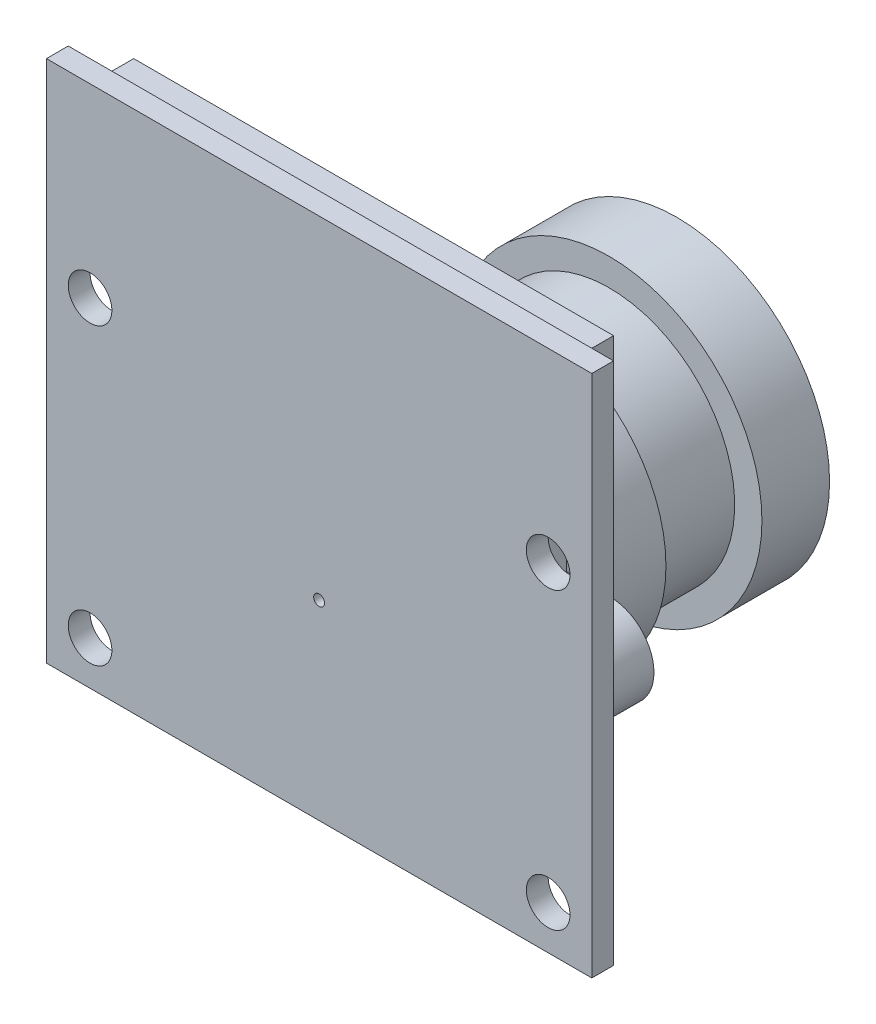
ISO-10303-21;
HEADER;
FILE_DESCRIPTION(('STEP AP214'),'2;1');
FILE_NAME('part.step','',(''),(''),'','','');
FILE_SCHEMA(('AUTOMOTIVE_DESIGN { 1 0 10303 214 1 1 1 1 }'));
ENDSEC;
DATA;
#1=APPLICATION_CONTEXT('core data for automotive mechanical design processes');
#2=APPLICATION_PROTOCOL_DEFINITION('international standard','automotive_design',2000,#1);
#3=PRODUCT_CONTEXT('',#1,'mechanical');
#4=PRODUCT('Part','Part','',(#3));
#5=PRODUCT_RELATED_PRODUCT_CATEGORY('part','',(#4));
#6=PRODUCT_DEFINITION_FORMATION('','',#4);
#7=PRODUCT_DEFINITION_CONTEXT('part definition',#1,'design');
#8=PRODUCT_DEFINITION('design','',#6,#7);
#9=PRODUCT_DEFINITION_SHAPE('','',#8);
#10=(LENGTH_UNIT() NAMED_UNIT(*) SI_UNIT(.MILLI.,.METRE.));
#11=(NAMED_UNIT(*) PLANE_ANGLE_UNIT() SI_UNIT($,.RADIAN.));
#12=(NAMED_UNIT(*) SI_UNIT($,.STERADIAN.) SOLID_ANGLE_UNIT());
#13=UNCERTAINTY_MEASURE_WITH_UNIT(LENGTH_MEASURE(1.E-05),#10,'distance_accuracy_value','');
#14=(GEOMETRIC_REPRESENTATION_CONTEXT(3) GLOBAL_UNCERTAINTY_ASSIGNED_CONTEXT((#13)) GLOBAL_UNIT_ASSIGNED_CONTEXT((#10,
#11,#12)) REPRESENTATION_CONTEXT('',''));
#15=CARTESIAN_POINT('',(0.,0.,0.));
#16=DIRECTION('',(0.,0.,1.));
#17=DIRECTION('',(1.,0.,0.));
#18=AXIS2_PLACEMENT_3D('',#15,#16,#17);
#19=CARTESIAN_POINT('',(3.94999511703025,8.74999999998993,-4.8));
#20=DIRECTION('',(0.,0.,1.));
#21=DIRECTION('',(1.,0.,0.));
#22=AXIS2_PLACEMENT_3D('',#19,#20,#21);
#23=PLANE('',#22);
#24=CARTESIAN_POINT('',(12.5,8.75,-4.8));
#25=DIRECTION('',(0.,0.,-1.));
#26=DIRECTION('',(-1.,0.,0.));
#27=AXIS2_PLACEMENT_3D('',#24,#25,#26);
#28=CIRCLE('',#27,6.6);
#29=CARTESIAN_POINT('',(13.3108637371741,15.2999999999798,-4.8));
#30=VERTEX_POINT('',#29);
#31=CARTESIAN_POINT('',(13.3108637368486,2.19999999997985,-4.8));
#32=VERTEX_POINT('',#31);
#33=EDGE_CURVE('E11',#30,#32,#28,.T.);
#34=ORIENTED_EDGE('',*,*,#33,.F.);
#35=DIRECTION('',(1.,0.,0.));
#36=VECTOR('',#35,1.);
#37=CARTESIAN_POINT('',(19.05,15.2999999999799,-4.8));
#38=LINE('',#37,#36);
#39=CARTESIAN_POINT('',(19.05,15.2999999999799,-4.8));
#40=VERTEX_POINT('',#39);
#41=EDGE_CURVE('E196',#30,#40,#38,.T.);
#42=ORIENTED_EDGE('',*,*,#41,.T.);
#43=DIRECTION('',(0.,-1.,0.));
#44=VECTOR('',#43,1.);
#45=CARTESIAN_POINT('',(19.05,10.75,-4.8));
#46=LINE('',#45,#44);
#47=CARTESIAN_POINT('',(19.05,10.75,-4.8));
#48=VERTEX_POINT('',#47);
#49=EDGE_CURVE('E193',#40,#48,#46,.T.);
#50=ORIENTED_EDGE('',*,*,#49,.T.);
#51=DIRECTION('',(1.,0.,0.));
#52=VECTOR('',#51,1.);
#53=CARTESIAN_POINT('',(21.0500097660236,10.75,-4.8));
#54=LINE('',#53,#52);
#55=CARTESIAN_POINT('',(21.0500097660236,10.75,-4.8));
#56=VERTEX_POINT('',#55);
#57=EDGE_CURVE('E249',#48,#56,#54,.T.);
#58=ORIENTED_EDGE('',*,*,#57,.T.);
#59=CARTESIAN_POINT('',(21.0500097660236,8.74999999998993,-4.8));
#60=DIRECTION('',(0.,0.,-1.));
#61=DIRECTION('',(1.,0.,0.));
#62=AXIS2_PLACEMENT_3D('',#59,#60,#61);
#63=CIRCLE('',#62,2.00000000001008);
#64=CARTESIAN_POINT('',(21.0500097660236,6.74999999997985,-4.8));
#65=VERTEX_POINT('',#64);
#66=EDGE_CURVE('E251',#56,#65,#63,.T.);
#67=ORIENTED_EDGE('',*,*,#66,.T.);
#68=DIRECTION('',(-1.,0.,0.));
#69=VECTOR('',#68,1.);
#70=CARTESIAN_POINT('',(19.05,6.74999999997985,-4.8));
#71=LINE('',#70,#69);
#72=CARTESIAN_POINT('',(19.05,6.74999999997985,-4.8));
#73=VERTEX_POINT('',#72);
#74=EDGE_CURVE('E253',#65,#73,#71,.T.);
#75=ORIENTED_EDGE('',*,*,#74,.T.);
#76=DIRECTION('',(0.,-1.,0.));
#77=VECTOR('',#76,1.);
#78=CARTESIAN_POINT('',(19.05,2.19999999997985,-4.8));
#79=LINE('',#78,#77);
#80=CARTESIAN_POINT('',(19.05,2.19999999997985,-4.8));
#81=VERTEX_POINT('',#80);
#82=EDGE_CURVE('E255',#73,#81,#79,.T.);
#83=ORIENTED_EDGE('',*,*,#82,.T.);
#84=DIRECTION('',(-1.,0.,0.));
#85=VECTOR('',#84,1.);
#86=CARTESIAN_POINT('',(5.95,2.19999999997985,-4.8));
#87=LINE('',#86,#85);
#88=EDGE_CURVE('E258',#81,#32,#87,.T.);
#89=ORIENTED_EDGE('',*,*,#88,.T.);
#90=EDGE_LOOP('',(#34,#42,#50,#58,#67,#75,#83,#89));
#91=FACE_BOUND('',#90,.T.);
#92=ADVANCED_FACE('F36',(#91),#23,.F.);
#93=CARTESIAN_POINT('',(0.,0.,-1.));
#94=DIRECTION('',(0.,0.,-1.));
#95=DIRECTION('',(-1.,0.,0.));
#96=AXIS2_PLACEMENT_3D('',#93,#94,#95);
#97=PLANE('',#96);
#98=CARTESIAN_POINT('',(2.,2.,-1.));
#99=DIRECTION('',(0.,0.,-1.));
#100=DIRECTION('',(-1.,0.,0.));
#101=AXIS2_PLACEMENT_3D('',#98,#99,#100);
#102=CIRCLE('',#101,0.999999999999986);
#103=CARTESIAN_POINT('',(1.00000000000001,2.,-1.));
#104=VERTEX_POINT('',#103);
#105=EDGE_CURVE('E781',#104,#104,#102,.T.);
#106=ORIENTED_EDGE('',*,*,#105,.F.);
#107=EDGE_LOOP('',(#106));
#108=FACE_BOUND('',#107,.T.);
#109=CARTESIAN_POINT('',(2.,15.5,-1.));
#110=DIRECTION('',(0.,0.,-1.));
#111=DIRECTION('',(-1.,0.,0.));
#112=AXIS2_PLACEMENT_3D('',#109,#110,#111);
#113=CIRCLE('',#112,0.999999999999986);
#114=CARTESIAN_POINT('',(1.00000000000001,15.5,-1.));
#115=VERTEX_POINT('',#114);
#116=EDGE_CURVE('E40',#115,#115,#113,.T.);
#117=ORIENTED_EDGE('',*,*,#116,.F.);
#118=EDGE_LOOP('',(#117));
#119=FACE_BOUND('',#118,.T.);
#120=CARTESIAN_POINT('',(23.,15.5,-1.));
#121=DIRECTION('',(0.,0.,-1.));
#122=DIRECTION('',(-1.,0.,0.));
#123=AXIS2_PLACEMENT_3D('',#120,#121,#122);
#124=CIRCLE('',#123,0.999999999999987);
#125=CARTESIAN_POINT('',(22.,15.5,-1.));
#126=VERTEX_POINT('',#125);
#127=EDGE_CURVE('E356',#126,#126,#124,.T.);
#128=ORIENTED_EDGE('',*,*,#127,.F.);
#129=EDGE_LOOP('',(#128));
#130=FACE_BOUND('',#129,.T.);
#131=CARTESIAN_POINT('',(23.,2.,-1.));
#132=DIRECTION('',(0.,0.,-1.));
#133=DIRECTION('',(-1.,0.,0.));
#134=AXIS2_PLACEMENT_3D('',#131,#132,#133);
#135=CIRCLE('',#134,0.999999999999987);
#136=CARTESIAN_POINT('',(22.,2.,-1.));
#137=VERTEX_POINT('',#136);
#138=EDGE_CURVE('E363',#137,#137,#135,.T.);
#139=ORIENTED_EDGE('',*,*,#138,.F.);
#140=EDGE_LOOP('',(#139));
#141=FACE_BOUND('',#140,.T.);
#142=DIRECTION('',(0.,-1.,0.));
#143=VECTOR('',#142,1.);
#144=CARTESIAN_POINT('',(25.,24.,-1.));
#145=LINE('',#144,#143);
#146=CARTESIAN_POINT('',(25.,24.,-1.));
#147=VERTEX_POINT('',#146);
#148=CARTESIAN_POINT('',(25.,0.,-1.));
#149=VERTEX_POINT('',#148);
#150=EDGE_CURVE('E326',#147,#149,#145,.T.);
#151=ORIENTED_EDGE('',*,*,#150,.T.);
#152=DIRECTION('',(-1.,0.,0.));
#153=VECTOR('',#152,1.);
#154=CARTESIAN_POINT('',(25.,0.,-1.));
#155=LINE('',#154,#153);
#156=CARTESIAN_POINT('',(0.,0.,-1.));
#157=VERTEX_POINT('',#156);
#158=EDGE_CURVE('E343',#149,#157,#155,.T.);
#159=ORIENTED_EDGE('',*,*,#158,.T.);
#160=DIRECTION('',(0.,1.,0.));
#161=VECTOR('',#160,1.);
#162=CARTESIAN_POINT('',(0.,0.,-1.));
#163=LINE('',#162,#161);
#164=CARTESIAN_POINT('',(0.,24.,-1.));
#165=VERTEX_POINT('',#164);
#166=EDGE_CURVE('E346',#157,#165,#163,.T.);
#167=ORIENTED_EDGE('',*,*,#166,.T.);
#168=DIRECTION('',(1.,0.,0.));
#169=VECTOR('',#168,1.);
#170=CARTESIAN_POINT('',(0.,24.,-1.));
#171=LINE('',#170,#169);
#172=EDGE_CURVE('E331',#165,#147,#171,.T.);
#173=ORIENTED_EDGE('',*,*,#172,.T.);
#174=EDGE_LOOP('',(#151,#159,#167,#173));
#175=FACE_BOUND('',#174,.T.);
#176=DIRECTION('',(1.,0.,0.));
#177=VECTOR('',#176,1.);
#178=CARTESIAN_POINT('',(19.05,15.2999999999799,-1.));
#179=LINE('',#178,#177);
#180=CARTESIAN_POINT('',(5.95,15.2999999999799,-1.));
#181=VERTEX_POINT('',#180);
#182=CARTESIAN_POINT('',(19.05,15.2999999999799,-1.));
#183=VERTEX_POINT('',#182);
#184=EDGE_CURVE('E271',#181,#183,#179,.T.);
#185=ORIENTED_EDGE('',*,*,#184,.F.);
#186=DIRECTION('',(0.,1.,0.));
#187=VECTOR('',#186,1.);
#188=CARTESIAN_POINT('',(5.95,15.2999999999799,-1.));
#189=LINE('',#188,#187);
#190=CARTESIAN_POINT('',(5.95,10.75,-1.));
#191=VERTEX_POINT('',#190);
#192=EDGE_CURVE('E245',#191,#181,#189,.T.);
#193=ORIENTED_EDGE('',*,*,#192,.F.);
#194=DIRECTION('',(1.,0.,0.));
#195=VECTOR('',#194,1.);
#196=CARTESIAN_POINT('',(5.95,10.75,-1.));
#197=LINE('',#196,#195);
#198=CARTESIAN_POINT('',(3.94999511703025,10.75,-1.));
#199=VERTEX_POINT('',#198);
#200=EDGE_CURVE('E246',#199,#191,#197,.T.);
#201=ORIENTED_EDGE('',*,*,#200,.F.);
#202=CARTESIAN_POINT('',(3.94999511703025,8.74999999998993,-1.));
#203=DIRECTION('',(0.,0.,-1.));
#204=DIRECTION('',(1.,0.,0.));
#205=AXIS2_PLACEMENT_3D('',#202,#203,#204);
#206=CIRCLE('',#205,2.00000000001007);
#207=CARTESIAN_POINT('',(3.94999511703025,6.74999999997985,-1.));
#208=VERTEX_POINT('',#207);
#209=EDGE_CURVE('E289',#208,#199,#206,.T.);
#210=ORIENTED_EDGE('',*,*,#209,.F.);
#211=DIRECTION('',(-1.,0.,0.));
#212=VECTOR('',#211,1.);
#213=CARTESIAN_POINT('',(3.94999511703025,6.74999999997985,-1.));
#214=LINE('',#213,#212);
#215=CARTESIAN_POINT('',(5.95,6.74999999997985,-1.));
#216=VERTEX_POINT('',#215);
#217=EDGE_CURVE('E287',#216,#208,#214,.T.);
#218=ORIENTED_EDGE('',*,*,#217,.F.);
#219=DIRECTION('',(0.,1.,0.));
#220=VECTOR('',#219,1.);
#221=CARTESIAN_POINT('',(5.95,6.74999999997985,-1.));
#222=LINE('',#221,#220);
#223=CARTESIAN_POINT('',(5.95,2.19999999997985,-1.));
#224=VERTEX_POINT('',#223);
#225=EDGE_CURVE('E285',#224,#216,#222,.T.);
#226=ORIENTED_EDGE('',*,*,#225,.F.);
#227=DIRECTION('',(-1.,0.,0.));
#228=VECTOR('',#227,1.);
#229=CARTESIAN_POINT('',(5.95,2.19999999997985,-1.));
#230=LINE('',#229,#228);
#231=CARTESIAN_POINT('',(19.05,2.19999999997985,-1.));
#232=VERTEX_POINT('',#231);
#233=EDGE_CURVE('E283',#232,#224,#230,.T.);
#234=ORIENTED_EDGE('',*,*,#233,.F.);
#235=DIRECTION('',(0.,-1.,0.));
#236=VECTOR('',#235,1.);
#237=CARTESIAN_POINT('',(19.05,2.19999999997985,-1.));
#238=LINE('',#237,#236);
#239=CARTESIAN_POINT('',(19.05,6.74999999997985,-1.));
#240=VERTEX_POINT('',#239);
#241=EDGE_CURVE('E281',#240,#232,#238,.T.);
#242=ORIENTED_EDGE('',*,*,#241,.F.);
#243=DIRECTION('',(-1.,0.,0.));
#244=VECTOR('',#243,1.);
#245=CARTESIAN_POINT('',(19.05,6.74999999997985,-1.));
#246=LINE('',#245,#244);
#247=CARTESIAN_POINT('',(21.0500097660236,6.74999999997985,-1.));
#248=VERTEX_POINT('',#247);
#249=EDGE_CURVE('E279',#248,#240,#246,.T.);
#250=ORIENTED_EDGE('',*,*,#249,.F.);
#251=CARTESIAN_POINT('',(21.0500097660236,8.74999999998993,-1.));
#252=DIRECTION('',(0.,0.,-1.));
#253=DIRECTION('',(1.,0.,0.));
#254=AXIS2_PLACEMENT_3D('',#251,#252,#253);
#255=CIRCLE('',#254,2.00000000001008);
#256=CARTESIAN_POINT('',(21.0500097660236,10.75,-1.));
#257=VERTEX_POINT('',#256);
#258=EDGE_CURVE('E277',#257,#248,#255,.T.);
#259=ORIENTED_EDGE('',*,*,#258,.F.);
#260=DIRECTION('',(1.,0.,0.));
#261=VECTOR('',#260,1.);
#262=CARTESIAN_POINT('',(21.0500097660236,10.75,-1.));
#263=LINE('',#262,#261);
#264=CARTESIAN_POINT('',(19.05,10.75,-1.));
#265=VERTEX_POINT('',#264);
#266=EDGE_CURVE('E275',#265,#257,#263,.T.);
#267=ORIENTED_EDGE('',*,*,#266,.F.);
#268=DIRECTION('',(0.,-1.,0.));
#269=VECTOR('',#268,1.);
#270=CARTESIAN_POINT('',(19.05,10.75,-1.));
#271=LINE('',#270,#269);
#272=EDGE_CURVE('E273',#183,#265,#271,.T.);
#273=ORIENTED_EDGE('',*,*,#272,.F.);
#274=EDGE_LOOP('',(#185,#193,#201,#210,#218,#226,#234,#242,#250,#259,#267,#273));
#275=FACE_BOUND('',#274,.T.);
#276=DIRECTION('',(0.,1.,0.));
#277=VECTOR('',#276,1.);
#278=CARTESIAN_POINT('',(1.5,23.5,-1.));
#279=LINE('',#278,#277);
#280=CARTESIAN_POINT('',(1.5,18.6977042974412,-1.));
#281=VERTEX_POINT('',#280);
#282=CARTESIAN_POINT('',(1.5,23.5,-1.));
#283=VERTEX_POINT('',#282);
#284=EDGE_CURVE('E214',#281,#283,#279,.T.);
#285=ORIENTED_EDGE('',*,*,#284,.F.);
#286=DIRECTION('',(-1.,0.,0.));
#287=VECTOR('',#286,1.);
#288=CARTESIAN_POINT('',(1.5,18.6977042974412,-1.));
#289=LINE('',#288,#287);
#290=CARTESIAN_POINT('',(23.5,18.6977042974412,-1.));
#291=VERTEX_POINT('',#290);
#292=EDGE_CURVE('E212',#291,#281,#289,.T.);
#293=ORIENTED_EDGE('',*,*,#292,.F.);
#294=DIRECTION('',(0.,-1.,0.));
#295=VECTOR('',#294,1.);
#296=CARTESIAN_POINT('',(23.5,18.6977042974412,-1.));
#297=LINE('',#296,#295);
#298=CARTESIAN_POINT('',(23.5,23.5,-1.));
#299=VERTEX_POINT('',#298);
#300=EDGE_CURVE('E224',#299,#291,#297,.T.);
#301=ORIENTED_EDGE('',*,*,#300,.F.);
#302=DIRECTION('',(1.,0.,0.));
#303=VECTOR('',#302,1.);
#304=CARTESIAN_POINT('',(23.5,23.5,-1.));
#305=LINE('',#304,#303);
#306=EDGE_CURVE('E232',#283,#299,#305,.T.);
#307=ORIENTED_EDGE('',*,*,#306,.F.);
#308=EDGE_LOOP('',(#285,#293,#301,#307));
#309=FACE_BOUND('',#308,.T.);
#310=ADVANCED_FACE('F413',(#108,#119,#130,#141,#175,#275,#309),#97,.T.);
#311=CARTESIAN_POINT('',(25.,24.,0.));
#312=DIRECTION('',(1.,0.,0.));
#313=DIRECTION('',(0.,0.,-1.));
#314=AXIS2_PLACEMENT_3D('',#311,#312,#313);
#315=PLANE('',#314);
#316=ORIENTED_EDGE('',*,*,#150,.F.);
#317=DIRECTION('',(0.,0.,-1.));
#318=VECTOR('',#317,1.);
#319=CARTESIAN_POINT('',(25.,24.,0.));
#320=LINE('',#319,#318);
#321=CARTESIAN_POINT('',(25.,24.,0.));
#322=VERTEX_POINT('',#321);
#323=EDGE_CURVE('E210',#322,#147,#320,.T.);
#324=ORIENTED_EDGE('',*,*,#323,.F.);
#325=DIRECTION('',(0.,-1.,0.));
#326=VECTOR('',#325,1.);
#327=CARTESIAN_POINT('',(25.,24.,0.));
#328=LINE('',#327,#326);
#329=CARTESIAN_POINT('',(25.,0.,0.));
#330=VERTEX_POINT('',#329);
#331=EDGE_CURVE('E327',#322,#330,#328,.T.);
#332=ORIENTED_EDGE('',*,*,#331,.T.);
#333=DIRECTION('',(0.,0.,-1.));
#334=VECTOR('',#333,1.);
#335=CARTESIAN_POINT('',(25.,0.,0.));
#336=LINE('',#335,#334);
#337=EDGE_CURVE('E340',#330,#149,#336,.T.);
#338=ORIENTED_EDGE('',*,*,#337,.T.);
#339=EDGE_LOOP('',(#316,#324,#332,#338));
#340=FACE_BOUND('',#339,.T.);
#341=ADVANCED_FACE('F38',(#340),#315,.T.);
#342=CARTESIAN_POINT('',(0.,24.,0.));
#343=DIRECTION('',(0.,1.,0.));
#344=DIRECTION('',(0.,0.,1.));
#345=AXIS2_PLACEMENT_3D('',#342,#343,#344);
#346=PLANE('',#345);
#347=ORIENTED_EDGE('',*,*,#172,.F.);
#348=DIRECTION('',(0.,0.,-1.));
#349=VECTOR('',#348,1.);
#350=CARTESIAN_POINT('',(0.,24.,0.));
#351=LINE('',#350,#349);
#352=CARTESIAN_POINT('',(0.,24.,0.));
#353=VERTEX_POINT('',#352);
#354=EDGE_CURVE('E352',#353,#165,#351,.T.);
#355=ORIENTED_EDGE('',*,*,#354,.F.);
#356=DIRECTION('',(1.,0.,0.));
#357=VECTOR('',#356,1.);
#358=CARTESIAN_POINT('',(0.,24.,0.));
#359=LINE('',#358,#357);
#360=EDGE_CURVE('E337',#353,#322,#359,.T.);
#361=ORIENTED_EDGE('',*,*,#360,.T.);
#362=ORIENTED_EDGE('',*,*,#323,.T.);
#363=EDGE_LOOP('',(#347,#355,#361,#362));
#364=FACE_BOUND('',#363,.T.);
#365=ADVANCED_FACE('F482',(#364),#346,.T.);
#366=CARTESIAN_POINT('',(0.,0.,0.));
#367=DIRECTION('',(-1.,0.,0.));
#368=DIRECTION('',(0.,0.,1.));
#369=AXIS2_PLACEMENT_3D('',#366,#367,#368);
#370=PLANE('',#369);
#371=ORIENTED_EDGE('',*,*,#166,.F.);
#372=DIRECTION('',(0.,0.,-1.));
#373=VECTOR('',#372,1.);
#374=CARTESIAN_POINT('',(0.,0.,0.));
#375=LINE('',#374,#373);
#376=CARTESIAN_POINT('',(0.,0.,0.));
#377=VERTEX_POINT('',#376);
#378=EDGE_CURVE('E354',#377,#157,#375,.T.);
#379=ORIENTED_EDGE('',*,*,#378,.F.);
#380=DIRECTION('',(0.,1.,0.));
#381=VECTOR('',#380,1.);
#382=CARTESIAN_POINT('',(0.,0.,0.));
#383=LINE('',#382,#381);
#384=EDGE_CURVE('E334',#377,#353,#383,.T.);
#385=ORIENTED_EDGE('',*,*,#384,.T.);
#386=ORIENTED_EDGE('',*,*,#354,.T.);
#387=EDGE_LOOP('',(#371,#379,#385,#386));
#388=FACE_BOUND('',#387,.T.);
#389=ADVANCED_FACE('F485',(#388),#370,.T.);
#390=CARTESIAN_POINT('',(25.,0.,0.));
#391=DIRECTION('',(0.,-1.,0.));
#392=DIRECTION('',(0.,0.,-1.));
#393=AXIS2_PLACEMENT_3D('',#390,#391,#392);
#394=PLANE('',#393);
#395=ORIENTED_EDGE('',*,*,#158,.F.);
#396=ORIENTED_EDGE('',*,*,#337,.F.);
#397=DIRECTION('',(-1.,0.,0.));
#398=VECTOR('',#397,1.);
#399=CARTESIAN_POINT('',(25.,0.,0.));
#400=LINE('',#399,#398);
#401=EDGE_CURVE('E330',#330,#377,#400,.T.);
#402=ORIENTED_EDGE('',*,*,#401,.T.);
#403=ORIENTED_EDGE('',*,*,#378,.T.);
#404=EDGE_LOOP('',(#395,#396,#402,#403));
#405=FACE_BOUND('',#404,.T.);
#406=ADVANCED_FACE('F479',(#405),#394,.T.);
#407=CARTESIAN_POINT('',(0.,0.,0.));
#408=DIRECTION('',(0.,0.,-1.));
#409=DIRECTION('',(-1.,0.,0.));
#410=AXIS2_PLACEMENT_3D('',#407,#408,#409);
#411=PLANE('',#410);
#412=CARTESIAN_POINT('',(2.,2.,0.));
#413=DIRECTION('',(0.,0.,1.));
#414=DIRECTION('',(1.,0.,0.));
#415=AXIS2_PLACEMENT_3D('',#412,#413,#414);
#416=CIRCLE('',#415,0.999999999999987);
#417=CARTESIAN_POINT('',(2.99999999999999,2.,0.));
#418=VERTEX_POINT('',#417);
#419=EDGE_CURVE('E784',#418,#418,#416,.T.);
#420=ORIENTED_EDGE('',*,*,#419,.F.);
#421=EDGE_LOOP('',(#420));
#422=FACE_BOUND('',#421,.T.);
#423=CARTESIAN_POINT('',(2.,15.5,0.));
#424=DIRECTION('',(0.,0.,1.));
#425=DIRECTION('',(1.,0.,0.));
#426=AXIS2_PLACEMENT_3D('',#423,#424,#425);
#427=CIRCLE('',#426,0.999999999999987);
#428=CARTESIAN_POINT('',(2.99999999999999,15.5,0.));
#429=VERTEX_POINT('',#428);
#430=EDGE_CURVE('E370',#429,#429,#427,.T.);
#431=ORIENTED_EDGE('',*,*,#430,.F.);
#432=EDGE_LOOP('',(#431));
#433=FACE_BOUND('',#432,.T.);
#434=CARTESIAN_POINT('',(23.,15.5,0.));
#435=DIRECTION('',(0.,0.,1.));
#436=DIRECTION('',(1.,0.,0.));
#437=AXIS2_PLACEMENT_3D('',#434,#435,#436);
#438=CIRCLE('',#437,0.999999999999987);
#439=CARTESIAN_POINT('',(24.,15.5,0.));
#440=VERTEX_POINT('',#439);
#441=EDGE_CURVE('E359',#440,#440,#438,.T.);
#442=ORIENTED_EDGE('',*,*,#441,.F.);
#443=EDGE_LOOP('',(#442));
#444=FACE_BOUND('',#443,.T.);
#445=CARTESIAN_POINT('',(23.,2.,0.));
#446=DIRECTION('',(0.,0.,1.));
#447=DIRECTION('',(1.,0.,0.));
#448=AXIS2_PLACEMENT_3D('',#445,#446,#447);
#449=CIRCLE('',#448,0.999999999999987);
#450=CARTESIAN_POINT('',(24.,2.,0.));
#451=VERTEX_POINT('',#450);
#452=EDGE_CURVE('E358',#451,#451,#449,.T.);
#453=ORIENTED_EDGE('',*,*,#452,.F.);
#454=EDGE_LOOP('',(#453));
#455=FACE_BOUND('',#454,.T.);
#456=CARTESIAN_POINT('',(12.5,8.75,0.));
#457=DIRECTION('',(0.,0.,1.));
#458=DIRECTION('',(1.,0.,0.));
#459=AXIS2_PLACEMENT_3D('',#456,#457,#458);
#460=CIRCLE('',#459,0.24999999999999);
#461=CARTESIAN_POINT('',(12.75,8.75,0.));
#462=VERTEX_POINT('',#461);
#463=EDGE_CURVE('E376',#462,#462,#460,.T.);
#464=ORIENTED_EDGE('',*,*,#463,.F.);
#465=EDGE_LOOP('',(#464));
#466=FACE_BOUND('',#465,.T.);
#467=ORIENTED_EDGE('',*,*,#331,.F.);
#468=ORIENTED_EDGE('',*,*,#360,.F.);
#469=ORIENTED_EDGE('',*,*,#384,.F.);
#470=ORIENTED_EDGE('',*,*,#401,.F.);
#471=EDGE_LOOP('',(#467,#468,#469,#470));
#472=FACE_BOUND('',#471,.T.);
#473=ADVANCED_FACE('F476',(#422,#433,#444,#455,#466,#472),#411,.F.);
#474=CARTESIAN_POINT('',(5.95,15.2999999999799,-4.8));
#475=DIRECTION('',(1.,0.,0.));
#476=DIRECTION('',(0.,0.,-1.));
#477=AXIS2_PLACEMENT_3D('',#474,#475,#476);
#478=PLANE('',#477);
#479=ORIENTED_EDGE('',*,*,#192,.T.);
#480=DIRECTION('',(0.,0.,1.));
#481=VECTOR('',#480,1.);
#482=CARTESIAN_POINT('',(5.95,15.2999999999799,-4.8));
#483=LINE('',#482,#481);
#484=CARTESIAN_POINT('',(5.95,15.2999999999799,-4.8));
#485=VERTEX_POINT('',#484);
#486=EDGE_CURVE('E324',#485,#181,#483,.T.);
#487=ORIENTED_EDGE('',*,*,#486,.F.);
#488=DIRECTION('',(0.,1.,0.));
#489=VECTOR('',#488,1.);
#490=CARTESIAN_POINT('',(5.95,15.2999999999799,-4.8));
#491=LINE('',#490,#489);
#492=CARTESIAN_POINT('',(5.95,10.75,-4.8));
#493=VERTEX_POINT('',#492);
#494=EDGE_CURVE('E190',#493,#485,#491,.T.);
#495=ORIENTED_EDGE('',*,*,#494,.F.);
#496=DIRECTION('',(0.,0.,1.));
#497=VECTOR('',#496,1.);
#498=CARTESIAN_POINT('',(5.95,10.75,-4.8));
#499=LINE('',#498,#497);
#500=EDGE_CURVE('E268',#493,#191,#499,.T.);
#501=ORIENTED_EDGE('',*,*,#500,.T.);
#502=EDGE_LOOP('',(#479,#487,#495,#501));
#503=FACE_BOUND('',#502,.T.);
#504=ADVANCED_FACE('F473',(#503),#478,.F.);
#505=CARTESIAN_POINT('',(19.05,15.2999999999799,-4.8));
#506=DIRECTION('',(0.,-1.,0.));
#507=DIRECTION('',(0.,0.,-1.));
#508=AXIS2_PLACEMENT_3D('',#505,#506,#507);
#509=PLANE('',#508);
#510=ORIENTED_EDGE('',*,*,#184,.T.);
#511=DIRECTION('',(0.,0.,1.));
#512=VECTOR('',#511,1.);
#513=CARTESIAN_POINT('',(19.05,15.2999999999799,-4.8));
#514=LINE('',#513,#512);
#515=EDGE_CURVE('E321',#40,#183,#514,.T.);
#516=ORIENTED_EDGE('',*,*,#515,.F.);
#517=ORIENTED_EDGE('',*,*,#41,.F.);
#518=CARTESIAN_POINT('',(11.6891362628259,15.2999999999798,-4.8));
#519=VERTEX_POINT('',#518);
#520=EDGE_CURVE('E194',#519,#30,#38,.T.);
#521=ORIENTED_EDGE('',*,*,#520,.F.);
#522=EDGE_CURVE('E186',#485,#519,#38,.T.);
#523=ORIENTED_EDGE('',*,*,#522,.F.);
#524=ORIENTED_EDGE('',*,*,#486,.T.);
#525=EDGE_LOOP('',(#510,#516,#517,#521,#523,#524));
#526=FACE_BOUND('',#525,.T.);
#527=ADVANCED_FACE('F199',(#526),#509,.F.);
#528=CARTESIAN_POINT('',(19.05,10.75,-4.8));
#529=DIRECTION('',(-1.,0.,0.));
#530=DIRECTION('',(0.,0.,1.));
#531=AXIS2_PLACEMENT_3D('',#528,#529,#530);
#532=PLANE('',#531);
#533=ORIENTED_EDGE('',*,*,#272,.T.);
#534=DIRECTION('',(0.,0.,1.));
#535=VECTOR('',#534,1.);
#536=CARTESIAN_POINT('',(19.05,10.75,-4.8));
#537=LINE('',#536,#535);
#538=EDGE_CURVE('E318',#48,#265,#537,.T.);
#539=ORIENTED_EDGE('',*,*,#538,.F.);
#540=ORIENTED_EDGE('',*,*,#49,.F.);
#541=ORIENTED_EDGE('',*,*,#515,.T.);
#542=EDGE_LOOP('',(#533,#539,#540,#541));
#543=FACE_BOUND('',#542,.T.);
#544=ADVANCED_FACE('F466',(#543),#532,.F.);
#545=CARTESIAN_POINT('',(21.0500097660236,10.75,-4.8));
#546=DIRECTION('',(0.,-1.,0.));
#547=DIRECTION('',(1.,0.,0.));
#548=AXIS2_PLACEMENT_3D('',#545,#546,#547);
#549=PLANE('',#548);
#550=ORIENTED_EDGE('',*,*,#266,.T.);
#551=DIRECTION('',(0.,0.,1.));
#552=VECTOR('',#551,1.);
#553=CARTESIAN_POINT('',(21.0500097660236,10.75,-4.8));
#554=LINE('',#553,#552);
#555=EDGE_CURVE('E315',#56,#257,#554,.T.);
#556=ORIENTED_EDGE('',*,*,#555,.F.);
#557=ORIENTED_EDGE('',*,*,#57,.F.);
#558=ORIENTED_EDGE('',*,*,#538,.T.);
#559=EDGE_LOOP('',(#550,#556,#557,#558));
#560=FACE_BOUND('',#559,.T.);
#561=ADVANCED_FACE('F462',(#560),#549,.F.);
#562=CARTESIAN_POINT('',(21.0500097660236,8.74999999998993,-4.8));
#563=DIRECTION('',(0.,0.,1.));
#564=DIRECTION('',(1.,0.,0.));
#565=AXIS2_PLACEMENT_3D('',#562,#563,#564);
#566=CYLINDRICAL_SURFACE('',#565,2.00000000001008);
#567=ORIENTED_EDGE('',*,*,#258,.T.);
#568=DIRECTION('',(0.,0.,1.));
#569=VECTOR('',#568,1.);
#570=CARTESIAN_POINT('',(21.0500097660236,6.74999999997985,-4.8));
#571=LINE('',#570,#569);
#572=EDGE_CURVE('E312',#65,#248,#571,.T.);
#573=ORIENTED_EDGE('',*,*,#572,.F.);
#574=ORIENTED_EDGE('',*,*,#66,.F.);
#575=ORIENTED_EDGE('',*,*,#555,.T.);
#576=EDGE_LOOP('',(#567,#573,#574,#575));
#577=FACE_BOUND('',#576,.T.);
#578=ADVANCED_FACE('F458',(#577),#566,.T.);
#579=CARTESIAN_POINT('',(19.05,6.74999999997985,-4.8));
#580=DIRECTION('',(0.,1.,0.));
#581=DIRECTION('',(-1.,0.,0.));
#582=AXIS2_PLACEMENT_3D('',#579,#580,#581);
#583=PLANE('',#582);
#584=ORIENTED_EDGE('',*,*,#249,.T.);
#585=DIRECTION('',(0.,0.,1.));
#586=VECTOR('',#585,1.);
#587=CARTESIAN_POINT('',(19.05,6.74999999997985,-4.8));
#588=LINE('',#587,#586);
#589=EDGE_CURVE('E309',#73,#240,#588,.T.);
#590=ORIENTED_EDGE('',*,*,#589,.F.);
#591=ORIENTED_EDGE('',*,*,#74,.F.);
#592=ORIENTED_EDGE('',*,*,#572,.T.);
#593=EDGE_LOOP('',(#584,#590,#591,#592));
#594=FACE_BOUND('',#593,.T.);
#595=ADVANCED_FACE('F454',(#594),#583,.F.);
#596=CARTESIAN_POINT('',(19.05,2.19999999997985,-4.8));
#597=DIRECTION('',(-1.,0.,0.));
#598=DIRECTION('',(0.,0.,1.));
#599=AXIS2_PLACEMENT_3D('',#596,#597,#598);
#600=PLANE('',#599);
#601=ORIENTED_EDGE('',*,*,#241,.T.);
#602=DIRECTION('',(0.,0.,1.));
#603=VECTOR('',#602,1.);
#604=CARTESIAN_POINT('',(19.05,2.19999999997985,-4.8));
#605=LINE('',#604,#603);
#606=EDGE_CURVE('E306',#81,#232,#605,.T.);
#607=ORIENTED_EDGE('',*,*,#606,.F.);
#608=ORIENTED_EDGE('',*,*,#82,.F.);
#609=ORIENTED_EDGE('',*,*,#589,.T.);
#610=EDGE_LOOP('',(#601,#607,#608,#609));
#611=FACE_BOUND('',#610,.T.);
#612=ADVANCED_FACE('F451',(#611),#600,.F.);
#613=CARTESIAN_POINT('',(5.95,2.19999999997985,-4.8));
#614=DIRECTION('',(0.,1.,0.));
#615=DIRECTION('',(-1.,0.,0.));
#616=AXIS2_PLACEMENT_3D('',#613,#614,#615);
#617=PLANE('',#616);
#618=ORIENTED_EDGE('',*,*,#233,.T.);
#619=DIRECTION('',(0.,0.,1.));
#620=VECTOR('',#619,1.);
#621=CARTESIAN_POINT('',(5.95,2.19999999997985,-4.8));
#622=LINE('',#621,#620);
#623=CARTESIAN_POINT('',(5.95,2.19999999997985,-4.8));
#624=VERTEX_POINT('',#623);
#625=EDGE_CURVE('E303',#624,#224,#622,.T.);
#626=ORIENTED_EDGE('',*,*,#625,.F.);
#627=CARTESIAN_POINT('',(11.6891362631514,2.19999999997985,-4.8));
#628=VERTEX_POINT('',#627);
#629=EDGE_CURVE('E257',#628,#624,#87,.T.);
#630=ORIENTED_EDGE('',*,*,#629,.F.);
#631=EDGE_CURVE('E60',#32,#628,#87,.T.);
#632=ORIENTED_EDGE('',*,*,#631,.F.);
#633=ORIENTED_EDGE('',*,*,#88,.F.);
#634=ORIENTED_EDGE('',*,*,#606,.T.);
#635=EDGE_LOOP('',(#618,#626,#630,#632,#633,#634));
#636=FACE_BOUND('',#635,.T.);
#637=ADVANCED_FACE('F447',(#636),#617,.F.);
#638=CARTESIAN_POINT('',(5.95,6.74999999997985,-4.8));
#639=DIRECTION('',(1.,0.,0.));
#640=DIRECTION('',(0.,0.,-1.));
#641=AXIS2_PLACEMENT_3D('',#638,#639,#640);
#642=PLANE('',#641);
#643=ORIENTED_EDGE('',*,*,#225,.T.);
#644=DIRECTION('',(0.,0.,1.));
#645=VECTOR('',#644,1.);
#646=CARTESIAN_POINT('',(5.95,6.74999999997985,-4.8));
#647=LINE('',#646,#645);
#648=CARTESIAN_POINT('',(5.95,6.74999999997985,-4.8));
#649=VERTEX_POINT('',#648);
#650=EDGE_CURVE('E300',#649,#216,#647,.T.);
#651=ORIENTED_EDGE('',*,*,#650,.F.);
#652=DIRECTION('',(0.,1.,0.));
#653=VECTOR('',#652,1.);
#654=CARTESIAN_POINT('',(5.95,6.74999999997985,-4.8));
#655=LINE('',#654,#653);
#656=EDGE_CURVE('E260',#624,#649,#655,.T.);
#657=ORIENTED_EDGE('',*,*,#656,.F.);
#658=ORIENTED_EDGE('',*,*,#625,.T.);
#659=EDGE_LOOP('',(#643,#651,#657,#658));
#660=FACE_BOUND('',#659,.T.);
#661=ADVANCED_FACE('F443',(#660),#642,.F.);
#662=CARTESIAN_POINT('',(3.94999511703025,6.74999999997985,-4.8));
#663=DIRECTION('',(0.,1.,0.));
#664=DIRECTION('',(-1.,0.,0.));
#665=AXIS2_PLACEMENT_3D('',#662,#663,#664);
#666=PLANE('',#665);
#667=ORIENTED_EDGE('',*,*,#217,.T.);
#668=DIRECTION('',(0.,0.,1.));
#669=VECTOR('',#668,1.);
#670=CARTESIAN_POINT('',(3.94999511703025,6.74999999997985,-4.8));
#671=LINE('',#670,#669);
#672=CARTESIAN_POINT('',(3.94999511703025,6.74999999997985,-4.8));
#673=VERTEX_POINT('',#672);
#674=EDGE_CURVE('E297',#673,#208,#671,.T.);
#675=ORIENTED_EDGE('',*,*,#674,.F.);
#676=DIRECTION('',(-1.,0.,0.));
#677=VECTOR('',#676,1.);
#678=CARTESIAN_POINT('',(3.94999511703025,6.74999999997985,-4.8));
#679=LINE('',#678,#677);
#680=EDGE_CURVE('E262',#649,#673,#679,.T.);
#681=ORIENTED_EDGE('',*,*,#680,.F.);
#682=ORIENTED_EDGE('',*,*,#650,.T.);
#683=EDGE_LOOP('',(#667,#675,#681,#682));
#684=FACE_BOUND('',#683,.T.);
#685=ADVANCED_FACE('F437',(#684),#666,.F.);
#686=CARTESIAN_POINT('',(3.94999511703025,8.74999999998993,-4.8));
#687=DIRECTION('',(0.,0.,1.));
#688=DIRECTION('',(1.,0.,0.));
#689=AXIS2_PLACEMENT_3D('',#686,#687,#688);
#690=CYLINDRICAL_SURFACE('',#689,2.00000000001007);
#691=ORIENTED_EDGE('',*,*,#209,.T.);
#692=DIRECTION('',(0.,0.,1.));
#693=VECTOR('',#692,1.);
#694=CARTESIAN_POINT('',(3.94999511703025,10.75,-4.8));
#695=LINE('',#694,#693);
#696=CARTESIAN_POINT('',(3.94999511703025,10.75,-4.8));
#697=VERTEX_POINT('',#696);
#698=EDGE_CURVE('E295',#697,#199,#695,.T.);
#699=ORIENTED_EDGE('',*,*,#698,.F.);
#700=CARTESIAN_POINT('',(3.94999511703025,8.74999999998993,-4.8));
#701=DIRECTION('',(0.,0.,-1.));
#702=DIRECTION('',(1.,0.,0.));
#703=AXIS2_PLACEMENT_3D('',#700,#701,#702);
#704=CIRCLE('',#703,2.00000000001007);
#705=EDGE_CURVE('E264',#673,#697,#704,.T.);
#706=ORIENTED_EDGE('',*,*,#705,.F.);
#707=ORIENTED_EDGE('',*,*,#674,.T.);
#708=EDGE_LOOP('',(#691,#699,#706,#707));
#709=FACE_BOUND('',#708,.T.);
#710=ADVANCED_FACE('F432',(#709),#690,.T.);
#711=CARTESIAN_POINT('',(5.95,10.75,-4.8));
#712=DIRECTION('',(0.,-1.,0.));
#713=DIRECTION('',(1.,0.,0.));
#714=AXIS2_PLACEMENT_3D('',#711,#712,#713);
#715=PLANE('',#714);
#716=ORIENTED_EDGE('',*,*,#200,.T.);
#717=ORIENTED_EDGE('',*,*,#500,.F.);
#718=DIRECTION('',(1.,0.,0.));
#719=VECTOR('',#718,1.);
#720=CARTESIAN_POINT('',(5.95,10.75,-4.8));
#721=LINE('',#720,#719);
#722=EDGE_CURVE('E266',#697,#493,#721,.T.);
#723=ORIENTED_EDGE('',*,*,#722,.F.);
#724=ORIENTED_EDGE('',*,*,#698,.T.);
#725=EDGE_LOOP('',(#716,#717,#723,#724));
#726=FACE_BOUND('',#725,.T.);
#727=ADVANCED_FACE('F425',(#726),#715,.F.);
#728=EDGE_CURVE('E45',#628,#519,#28,.T.);
#729=ORIENTED_EDGE('',*,*,#728,.F.);
#730=ORIENTED_EDGE('',*,*,#629,.T.);
#731=ORIENTED_EDGE('',*,*,#656,.T.);
#732=ORIENTED_EDGE('',*,*,#680,.T.);
#733=ORIENTED_EDGE('',*,*,#705,.T.);
#734=ORIENTED_EDGE('',*,*,#722,.T.);
#735=ORIENTED_EDGE('',*,*,#494,.T.);
#736=ORIENTED_EDGE('',*,*,#522,.T.);
#737=EDGE_LOOP('',(#729,#730,#731,#732,#733,#734,#735,#736));
#738=FACE_BOUND('',#737,.T.);
#739=ADVANCED_FACE('F188',(#738),#23,.F.);
#740=CARTESIAN_POINT('',(1.5,18.6977042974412,-2.5));
#741=DIRECTION('',(0.,1.,0.));
#742=DIRECTION('',(0.,0.,1.));
#743=AXIS2_PLACEMENT_3D('',#740,#741,#742);
#744=PLANE('',#743);
#745=ORIENTED_EDGE('',*,*,#292,.T.);
#746=DIRECTION('',(0.,0.,1.));
#747=VECTOR('',#746,1.);
#748=CARTESIAN_POINT('',(1.5,18.6977042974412,-2.5));
#749=LINE('',#748,#747);
#750=CARTESIAN_POINT('',(1.5,18.6977042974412,-2.5));
#751=VERTEX_POINT('',#750);
#752=EDGE_CURVE('E243',#751,#281,#749,.T.);
#753=ORIENTED_EDGE('',*,*,#752,.F.);
#754=DIRECTION('',(-1.,0.,0.));
#755=VECTOR('',#754,1.);
#756=CARTESIAN_POINT('',(1.5,18.6977042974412,-2.5));
#757=LINE('',#756,#755);
#758=CARTESIAN_POINT('',(23.5,18.6977042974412,-2.5));
#759=VERTEX_POINT('',#758);
#760=EDGE_CURVE('E220',#759,#751,#757,.T.);
#761=ORIENTED_EDGE('',*,*,#760,.F.);
#762=DIRECTION('',(0.,0.,1.));
#763=VECTOR('',#762,1.);
#764=CARTESIAN_POINT('',(23.5,18.6977042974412,-2.5));
#765=LINE('',#764,#763);
#766=EDGE_CURVE('E229',#759,#291,#765,.T.);
#767=ORIENTED_EDGE('',*,*,#766,.T.);
#768=EDGE_LOOP('',(#745,#753,#761,#767));
#769=FACE_BOUND('',#768,.T.);
#770=ADVANCED_FACE('F424',(#769),#744,.F.);
#771=CARTESIAN_POINT('',(1.5,23.5,-2.5));
#772=DIRECTION('',(1.,0.,0.));
#773=DIRECTION('',(0.,1.,0.));
#774=AXIS2_PLACEMENT_3D('',#771,#772,#773);
#775=PLANE('',#774);
#776=ORIENTED_EDGE('',*,*,#284,.T.);
#777=DIRECTION('',(0.,0.,1.));
#778=VECTOR('',#777,1.);
#779=CARTESIAN_POINT('',(1.5,23.5,-2.5));
#780=LINE('',#779,#778);
#781=CARTESIAN_POINT('',(1.5,23.5,-2.5));
#782=VERTEX_POINT('',#781);
#783=EDGE_CURVE('E240',#782,#283,#780,.T.);
#784=ORIENTED_EDGE('',*,*,#783,.F.);
#785=DIRECTION('',(0.,1.,0.));
#786=VECTOR('',#785,1.);
#787=CARTESIAN_POINT('',(1.5,23.5,-2.5));
#788=LINE('',#787,#786);
#789=EDGE_CURVE('E223',#751,#782,#788,.T.);
#790=ORIENTED_EDGE('',*,*,#789,.F.);
#791=ORIENTED_EDGE('',*,*,#752,.T.);
#792=EDGE_LOOP('',(#776,#784,#790,#791));
#793=FACE_BOUND('',#792,.T.);
#794=ADVANCED_FACE('F430',(#793),#775,.F.);
#795=CARTESIAN_POINT('',(23.5,23.5,-2.5));
#796=DIRECTION('',(0.,-1.,0.));
#797=DIRECTION('',(0.,0.,-1.));
#798=AXIS2_PLACEMENT_3D('',#795,#796,#797);
#799=PLANE('',#798);
#800=ORIENTED_EDGE('',*,*,#306,.T.);
#801=DIRECTION('',(0.,0.,1.));
#802=VECTOR('',#801,1.);
#803=CARTESIAN_POINT('',(23.5,23.5,-2.5));
#804=LINE('',#803,#802);
#805=CARTESIAN_POINT('',(23.5,23.5,-2.5));
#806=VERTEX_POINT('',#805);
#807=EDGE_CURVE('E238',#806,#299,#804,.T.);
#808=ORIENTED_EDGE('',*,*,#807,.F.);
#809=DIRECTION('',(1.,0.,0.));
#810=VECTOR('',#809,1.);
#811=CARTESIAN_POINT('',(23.5,23.5,-2.5));
#812=LINE('',#811,#810);
#813=EDGE_CURVE('E226',#782,#806,#812,.T.);
#814=ORIENTED_EDGE('',*,*,#813,.F.);
#815=ORIENTED_EDGE('',*,*,#783,.T.);
#816=EDGE_LOOP('',(#800,#808,#814,#815));
#817=FACE_BOUND('',#816,.T.);
#818=ADVANCED_FACE('F600',(#817),#799,.F.);
#819=CARTESIAN_POINT('',(23.5,18.6977042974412,-2.5));
#820=DIRECTION('',(-1.,0.,0.));
#821=DIRECTION('',(0.,0.,1.));
#822=AXIS2_PLACEMENT_3D('',#819,#820,#821);
#823=PLANE('',#822);
#824=ORIENTED_EDGE('',*,*,#300,.T.);
#825=ORIENTED_EDGE('',*,*,#766,.F.);
#826=DIRECTION('',(0.,-1.,0.));
#827=VECTOR('',#826,1.);
#828=CARTESIAN_POINT('',(23.5,18.6977042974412,-2.5));
#829=LINE('',#828,#827);
#830=EDGE_CURVE('E228',#806,#759,#829,.T.);
#831=ORIENTED_EDGE('',*,*,#830,.F.);
#832=ORIENTED_EDGE('',*,*,#807,.T.);
#833=EDGE_LOOP('',(#824,#825,#831,#832));
#834=FACE_BOUND('',#833,.T.);
#835=ADVANCED_FACE('F610',(#834),#823,.F.);
#836=CARTESIAN_POINT('',(0.,0.,-2.5));
#837=DIRECTION('',(0.,0.,1.));
#838=DIRECTION('',(1.,0.,0.));
#839=AXIS2_PLACEMENT_3D('',#836,#837,#838);
#840=PLANE('',#839);
#841=ORIENTED_EDGE('',*,*,#760,.T.);
#842=ORIENTED_EDGE('',*,*,#789,.T.);
#843=ORIENTED_EDGE('',*,*,#813,.T.);
#844=ORIENTED_EDGE('',*,*,#830,.T.);
#845=EDGE_LOOP('',(#841,#842,#843,#844));
#846=FACE_BOUND('',#845,.T.);
#847=ADVANCED_FACE('F620',(#846),#840,.F.);
#848=CARTESIAN_POINT('',(19.1,8.75,-4.8));
#849=DIRECTION('',(0.,0.,1.));
#850=DIRECTION('',(1.,0.,0.));
#851=AXIS2_PLACEMENT_3D('',#848,#849,#850);
#852=PLANE('',#851);
#853=EDGE_CURVE('E208',#519,#30,#28,.T.);
#854=ORIENTED_EDGE('',*,*,#853,.F.);
#855=ORIENTED_EDGE('',*,*,#520,.T.);
#856=EDGE_LOOP('',(#854,#855));
#857=FACE_BOUND('',#856,.T.);
#858=ADVANCED_FACE('F211',(#857),#852,.T.);
#859=CARTESIAN_POINT('',(12.5,8.75,-4.8));
#860=DIRECTION('',(0.,0.,-1.));
#861=DIRECTION('',(-1.,0.,0.));
#862=AXIS2_PLACEMENT_3D('',#859,#860,#861);
#863=CYLINDRICAL_SURFACE('',#862,6.6);
#864=ORIENTED_EDGE('',*,*,#853,.T.);
#865=ORIENTED_EDGE('',*,*,#33,.T.);
#866=EDGE_CURVE('E47',#32,#628,#28,.T.);
#867=ORIENTED_EDGE('',*,*,#866,.T.);
#868=ORIENTED_EDGE('',*,*,#728,.T.);
#869=EDGE_LOOP('',(#864,#865,#867,#868));
#870=FACE_BOUND('',#869,.T.);
#871=CARTESIAN_POINT('',(12.5,8.75,-9.3));
#872=DIRECTION('',(0.,0.,-1.));
#873=DIRECTION('',(-1.,0.,0.));
#874=AXIS2_PLACEMENT_3D('',#871,#872,#873);
#875=CIRCLE('',#874,6.6);
#876=CARTESIAN_POINT('',(5.9,8.75,-9.3));
#877=VERTEX_POINT('',#876);
#878=EDGE_CURVE('E382',#877,#877,#875,.T.);
#879=ORIENTED_EDGE('',*,*,#878,.F.);
#880=EDGE_LOOP('',(#879));
#881=FACE_BOUND('',#880,.T.);
#882=ADVANCED_FACE('F206',(#870,#881),#863,.T.);
#883=ORIENTED_EDGE('',*,*,#866,.F.);
#884=ORIENTED_EDGE('',*,*,#631,.T.);
#885=EDGE_LOOP('',(#883,#884));
#886=FACE_BOUND('',#885,.T.);
#887=ADVANCED_FACE('F410',(#886),#852,.T.);
#888=CARTESIAN_POINT('',(12.5,8.75,-16.4));
#889=DIRECTION('',(0.,0.,-1.));
#890=DIRECTION('',(-1.,0.,0.));
#891=AXIS2_PLACEMENT_3D('',#888,#889,#890);
#892=PLANE('',#891);
#893=CARTESIAN_POINT('',(12.5,8.75,-16.4));
#894=DIRECTION('',(0.,0.,-1.));
#895=DIRECTION('',(-1.,0.,0.));
#896=AXIS2_PLACEMENT_3D('',#893,#894,#895);
#897=CIRCLE('',#896,7.);
#898=CARTESIAN_POINT('',(5.5,8.75,-16.4));
#899=VERTEX_POINT('',#898);
#900=EDGE_CURVE('E216',#899,#899,#897,.T.);
#901=ORIENTED_EDGE('',*,*,#900,.T.);
#902=EDGE_LOOP('',(#901));
#903=FACE_BOUND('',#902,.T.);
#904=ADVANCED_FACE('F397',(#903),#892,.T.);
#905=CARTESIAN_POINT('',(12.5,8.75,-4.8));
#906=DIRECTION('',(0.,0.,-1.));
#907=DIRECTION('',(-1.,0.,0.));
#908=AXIS2_PLACEMENT_3D('',#905,#906,#907);
#909=CYLINDRICAL_SURFACE('',#908,7.);
#910=CARTESIAN_POINT('',(12.5,8.75,-13.3));
#911=DIRECTION('',(0.,0.,-1.));
#912=DIRECTION('',(-1.,0.,0.));
#913=AXIS2_PLACEMENT_3D('',#910,#911,#912);
#914=CIRCLE('',#913,7.);
#915=CARTESIAN_POINT('',(5.5,8.75,-13.3));
#916=VERTEX_POINT('',#915);
#917=EDGE_CURVE('E390',#916,#916,#914,.T.);
#918=ORIENTED_EDGE('',*,*,#917,.T.);
#919=EDGE_LOOP('',(#918));
#920=FACE_BOUND('',#919,.T.);
#921=ORIENTED_EDGE('',*,*,#900,.F.);
#922=EDGE_LOOP('',(#921));
#923=FACE_BOUND('',#922,.T.);
#924=ADVANCED_FACE('F399',(#920,#923),#909,.T.);
#925=CARTESIAN_POINT('',(19.5,8.75,-13.3));
#926=DIRECTION('',(0.,0.,1.));
#927=DIRECTION('',(1.,0.,0.));
#928=AXIS2_PLACEMENT_3D('',#925,#926,#927);
#929=PLANE('',#928);
#930=CARTESIAN_POINT('',(12.5,8.75,-13.3));
#931=DIRECTION('',(0.,0.,-1.));
#932=DIRECTION('',(-1.,0.,0.));
#933=AXIS2_PLACEMENT_3D('',#930,#931,#932);
#934=CIRCLE('',#933,5.75);
#935=CARTESIAN_POINT('',(6.75,8.75,-13.3));
#936=VERTEX_POINT('',#935);
#937=EDGE_CURVE('E388',#936,#936,#934,.T.);
#938=ORIENTED_EDGE('',*,*,#937,.T.);
#939=EDGE_LOOP('',(#938));
#940=FACE_BOUND('',#939,.T.);
#941=ORIENTED_EDGE('',*,*,#917,.F.);
#942=EDGE_LOOP('',(#941));
#943=FACE_BOUND('',#942,.T.);
#944=ADVANCED_FACE('F401',(#940,#943),#929,.T.);
#945=CARTESIAN_POINT('',(12.5,8.75,-4.8));
#946=DIRECTION('',(0.,0.,-1.));
#947=DIRECTION('',(-1.,0.,0.));
#948=AXIS2_PLACEMENT_3D('',#945,#946,#947);
#949=CYLINDRICAL_SURFACE('',#948,5.75);
#950=CARTESIAN_POINT('',(12.5,8.75,-9.3));
#951=DIRECTION('',(0.,0.,-1.));
#952=DIRECTION('',(-1.,0.,0.));
#953=AXIS2_PLACEMENT_3D('',#950,#951,#952);
#954=CIRCLE('',#953,5.75);
#955=CARTESIAN_POINT('',(6.75,8.75,-9.3));
#956=VERTEX_POINT('',#955);
#957=EDGE_CURVE('E385',#956,#956,#954,.T.);
#958=ORIENTED_EDGE('',*,*,#957,.T.);
#959=EDGE_LOOP('',(#958));
#960=FACE_BOUND('',#959,.T.);
#961=ORIENTED_EDGE('',*,*,#937,.F.);
#962=EDGE_LOOP('',(#961));
#963=FACE_BOUND('',#962,.T.);
#964=ADVANCED_FACE('F407',(#960,#963),#949,.T.);
#965=CARTESIAN_POINT('',(18.25,8.75,-9.3));
#966=DIRECTION('',(0.,0.,-1.));
#967=DIRECTION('',(-1.,0.,0.));
#968=AXIS2_PLACEMENT_3D('',#965,#966,#967);
#969=PLANE('',#968);
#970=ORIENTED_EDGE('',*,*,#878,.T.);
#971=EDGE_LOOP('',(#970));
#972=FACE_BOUND('',#971,.T.);
#973=ORIENTED_EDGE('',*,*,#957,.F.);
#974=EDGE_LOOP('',(#973));
#975=FACE_BOUND('',#974,.T.);
#976=ADVANCED_FACE('F697',(#972,#975),#969,.T.);
#977=CARTESIAN_POINT('',(12.5,8.75,-1.));
#978=DIRECTION('',(0.,0.,-1.));
#979=DIRECTION('',(-1.,0.,0.));
#980=AXIS2_PLACEMENT_3D('',#977,#978,#979);
#981=PLANE('',#980);
#982=CARTESIAN_POINT('',(12.5,8.75,-1.));
#983=DIRECTION('',(0.,0.,1.));
#984=DIRECTION('',(1.,0.,0.));
#985=AXIS2_PLACEMENT_3D('',#982,#983,#984);
#986=CIRCLE('',#985,0.24999999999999);
#987=CARTESIAN_POINT('',(12.75,8.75,-1.));
#988=VERTEX_POINT('',#987);
#989=EDGE_CURVE('E379',#988,#988,#986,.T.);
#990=ORIENTED_EDGE('',*,*,#989,.T.);
#991=EDGE_LOOP('',(#990));
#992=FACE_BOUND('',#991,.T.);
#993=ADVANCED_FACE('F707',(#992),#981,.F.);
#994=CARTESIAN_POINT('',(12.5,8.75,0.));
#995=DIRECTION('',(0.,0.,1.));
#996=DIRECTION('',(1.,0.,0.));
#997=AXIS2_PLACEMENT_3D('',#994,#995,#996);
#998=CYLINDRICAL_SURFACE('',#997,0.24999999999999);
#999=ORIENTED_EDGE('',*,*,#989,.F.);
#1000=EDGE_LOOP('',(#999));
#1001=FACE_BOUND('',#1000,.T.);
#1002=ORIENTED_EDGE('',*,*,#463,.T.);
#1003=EDGE_LOOP('',(#1002));
#1004=FACE_BOUND('',#1003,.T.);
#1005=ADVANCED_FACE('F717',(#1001,#1004),#998,.F.);
#1006=CARTESIAN_POINT('',(23.,2.,0.));
#1007=DIRECTION('',(0.,0.,1.));
#1008=DIRECTION('',(1.,0.,0.));
#1009=AXIS2_PLACEMENT_3D('',#1006,#1007,#1008);
#1010=CYLINDRICAL_SURFACE('',#1009,0.999999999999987);
#1011=ORIENTED_EDGE('',*,*,#138,.T.);
#1012=EDGE_LOOP('',(#1011));
#1013=FACE_BOUND('',#1012,.T.);
#1014=ORIENTED_EDGE('',*,*,#452,.T.);
#1015=EDGE_LOOP('',(#1014));
#1016=FACE_BOUND('',#1015,.T.);
#1017=ADVANCED_FACE('F726',(#1013,#1016),#1010,.F.);
#1018=CARTESIAN_POINT('',(23.,15.5,0.));
#1019=DIRECTION('',(0.,0.,1.));
#1020=DIRECTION('',(1.,0.,0.));
#1021=AXIS2_PLACEMENT_3D('',#1018,#1019,#1020);
#1022=CYLINDRICAL_SURFACE('',#1021,0.999999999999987);
#1023=ORIENTED_EDGE('',*,*,#127,.T.);
#1024=EDGE_LOOP('',(#1023));
#1025=FACE_BOUND('',#1024,.T.);
#1026=ORIENTED_EDGE('',*,*,#441,.T.);
#1027=EDGE_LOOP('',(#1026));
#1028=FACE_BOUND('',#1027,.T.);
#1029=ADVANCED_FACE('F745',(#1025,#1028),#1022,.F.);
#1030=CARTESIAN_POINT('',(2.,15.5,0.));
#1031=DIRECTION('',(0.,0.,1.));
#1032=DIRECTION('',(1.,0.,0.));
#1033=AXIS2_PLACEMENT_3D('',#1030,#1031,#1032);
#1034=CYLINDRICAL_SURFACE('',#1033,0.999999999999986);
#1035=ORIENTED_EDGE('',*,*,#116,.T.);
#1036=EDGE_LOOP('',(#1035));
#1037=FACE_BOUND('',#1036,.T.);
#1038=ORIENTED_EDGE('',*,*,#430,.T.);
#1039=EDGE_LOOP('',(#1038));
#1040=FACE_BOUND('',#1039,.T.);
#1041=ADVANCED_FACE('F755',(#1037,#1040),#1034,.F.);
#1042=CARTESIAN_POINT('',(2.,2.,0.));
#1043=DIRECTION('',(0.,0.,1.));
#1044=DIRECTION('',(1.,0.,0.));
#1045=AXIS2_PLACEMENT_3D('',#1042,#1043,#1044);
#1046=CYLINDRICAL_SURFACE('',#1045,0.999999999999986);
#1047=ORIENTED_EDGE('',*,*,#105,.T.);
#1048=EDGE_LOOP('',(#1047));
#1049=FACE_BOUND('',#1048,.T.);
#1050=ORIENTED_EDGE('',*,*,#419,.T.);
#1051=EDGE_LOOP('',(#1050));
#1052=FACE_BOUND('',#1051,.T.);
#1053=ADVANCED_FACE('F764',(#1049,#1052),#1046,.F.);
#1054=CLOSED_SHELL('',(#92,#310,#341,#365,#389,#406,#473,#504,#527,#544,#561,#578,#595,#612,
#637,#661,#685,#710,#727,#739,#770,#794,#818,#835,#847,#858,#882,#887,#904,#924,#944,#964,#976,
#993,#1005,#1017,#1029,#1041,#1053));
#1055=MANIFOLD_SOLID_BREP('B2',#1054);
#1056=ADVANCED_BREP_SHAPE_REPRESENTATION('',(#18,#1055),#14);
#1057=SHAPE_DEFINITION_REPRESENTATION(#9,#1056);
ENDSEC;
END-ISO-10303-21;
